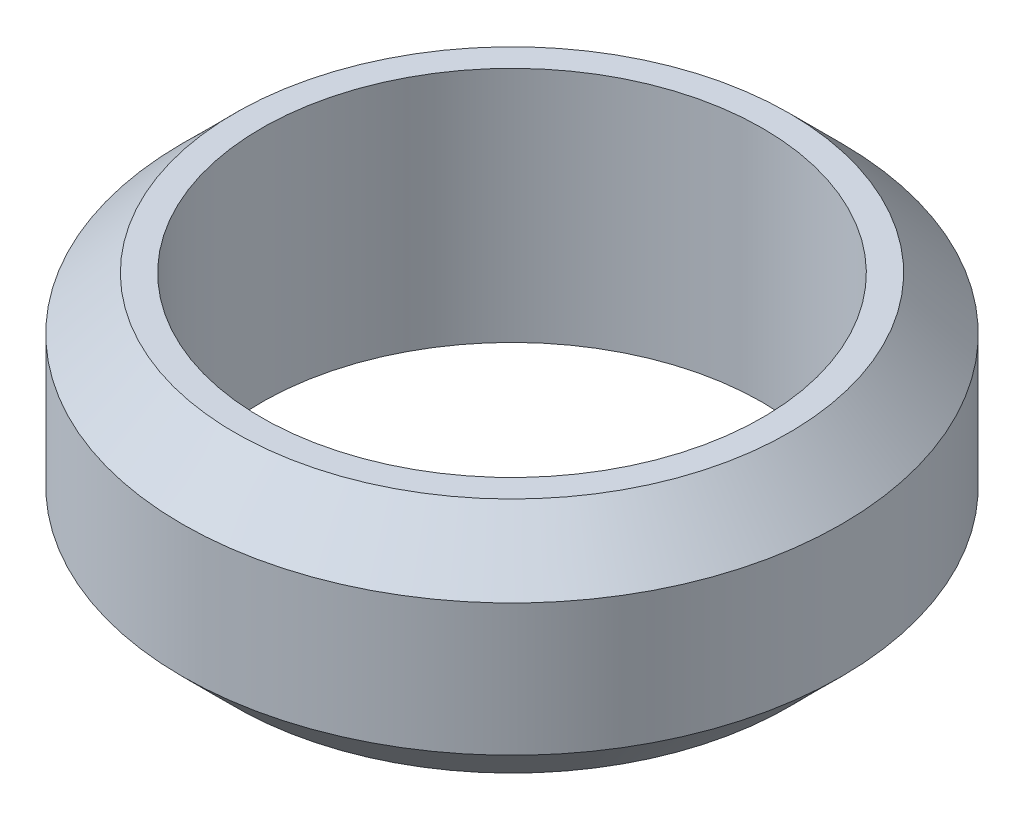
from build123d import *


with BuildPart() as part:
    # Croquis2 → Revoluci_n1 (revolve)
    with BuildSketch(Plane.XY, mode=Mode.PRIVATE) as revoluci_n1_sk:
        Polygon((-21, 13.607127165), (-19, 13.607127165), (-19, -4.392872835), (-21, -4.392872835), (-25, -0.392872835), (-25, 9.607127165), align=None)
    revolve(revoluci_n1_sk.sketch.rotate(Axis((0, 0, 0), (0, 1, 0)), 270), axis=Axis((0, 0, 0), (0, 1, 0)))


solid = part.part
